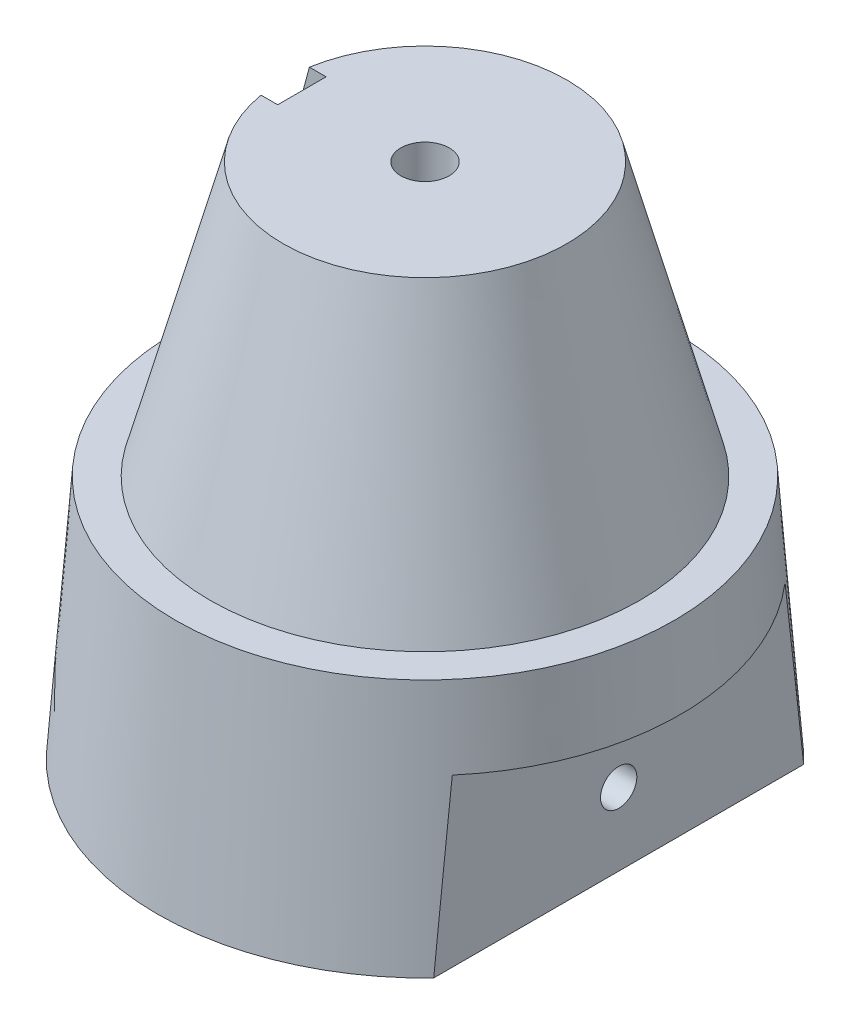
ISO-10303-21;
HEADER;
FILE_DESCRIPTION(('STEP AP214'),'2;1');
FILE_NAME('part.step','',(''),(''),'','','');
FILE_SCHEMA(('AUTOMOTIVE_DESIGN { 1 0 10303 214 1 1 1 1 }'));
ENDSEC;
DATA;
#1=APPLICATION_CONTEXT('core data for automotive mechanical design processes');
#2=APPLICATION_PROTOCOL_DEFINITION('international standard','automotive_design',2000,#1);
#3=PRODUCT_CONTEXT('',#1,'mechanical');
#4=PRODUCT('Part','Part','',(#3));
#5=PRODUCT_RELATED_PRODUCT_CATEGORY('part','',(#4));
#6=PRODUCT_DEFINITION_FORMATION('','',#4);
#7=PRODUCT_DEFINITION_CONTEXT('part definition',#1,'design');
#8=PRODUCT_DEFINITION('design','',#6,#7);
#9=PRODUCT_DEFINITION_SHAPE('','',#8);
#10=(LENGTH_UNIT() NAMED_UNIT(*) SI_UNIT(.MILLI.,.METRE.));
#11=(NAMED_UNIT(*) PLANE_ANGLE_UNIT() SI_UNIT($,.RADIAN.));
#12=(NAMED_UNIT(*) SI_UNIT($,.STERADIAN.) SOLID_ANGLE_UNIT());
#13=UNCERTAINTY_MEASURE_WITH_UNIT(LENGTH_MEASURE(1.E-05),#10,'distance_accuracy_value','');
#14=(GEOMETRIC_REPRESENTATION_CONTEXT(3) GLOBAL_UNCERTAINTY_ASSIGNED_CONTEXT((#13)) GLOBAL_UNIT_ASSIGNED_CONTEXT((#10,
#11,#12)) REPRESENTATION_CONTEXT('',''));
#15=CARTESIAN_POINT('',(0.,0.,0.));
#16=DIRECTION('',(0.,0.,1.));
#17=DIRECTION('',(1.,0.,0.));
#18=AXIS2_PLACEMENT_3D('',#15,#16,#17);
#19=CARTESIAN_POINT('',(0.,85.5,-23.4422863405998));
#20=DIRECTION('',(0.,-1.,0.));
#21=DIRECTION('',(0.,0.,-1.));
#22=AXIS2_PLACEMENT_3D('',#19,#20,#21);
#23=PLANE('',#22);
#24=CARTESIAN_POINT('',(0.,85.5,0.));
#25=DIRECTION('',(0.,1.,0.));
#26=DIRECTION('',(0.,0.,1.));
#27=AXIS2_PLACEMENT_3D('',#24,#25,#26);
#28=CIRCLE('',#27,3.99999999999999);
#29=CARTESIAN_POINT('',(0.,85.5,3.99999999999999));
#30=VERTEX_POINT('',#29);
#31=EDGE_CURVE('E244',#30,#30,#28,.T.);
#32=ORIENTED_EDGE('',*,*,#31,.F.);
#33=EDGE_LOOP('',(#32));
#34=FACE_BOUND('',#33,.T.);
#35=DIRECTION('',(1.,0.,0.));
#36=VECTOR('',#35,1.);
#37=CARTESIAN_POINT('',(0.,85.5,4.));
#38=LINE('',#37,#36);
#39=CARTESIAN_POINT('',(-23.0985018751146,85.5,4.));
#40=VERTEX_POINT('',#39);
#41=CARTESIAN_POINT('',(-20.3369652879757,85.5,4.));
#42=VERTEX_POINT('',#41);
#43=EDGE_CURVE('E125',#40,#42,#38,.T.);
#44=ORIENTED_EDGE('',*,*,#43,.F.);
#45=CARTESIAN_POINT('',(0.,85.5,0.));
#46=DIRECTION('',(0.,1.,0.));
#47=DIRECTION('',(0.,0.,1.));
#48=AXIS2_PLACEMENT_3D('',#45,#46,#47);
#49=CIRCLE('',#48,23.4422863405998);
#50=CARTESIAN_POINT('',(-23.0985018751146,85.5,-4.));
#51=VERTEX_POINT('',#50);
#52=EDGE_CURVE('E124',#40,#51,#49,.T.);
#53=ORIENTED_EDGE('',*,*,#52,.T.);
#54=DIRECTION('',(-1.,0.,0.));
#55=VECTOR('',#54,1.);
#56=CARTESIAN_POINT('',(0.,85.5,-4.));
#57=LINE('',#56,#55);
#58=CARTESIAN_POINT('',(-20.3369652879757,85.5,-4.));
#59=VERTEX_POINT('',#58);
#60=EDGE_CURVE('E105',#59,#51,#57,.T.);
#61=ORIENTED_EDGE('',*,*,#60,.F.);
#62=DIRECTION('',(0.,0.,-1.));
#63=VECTOR('',#62,1.);
#64=CARTESIAN_POINT('',(-20.3369652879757,85.5,-23.4422863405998));
#65=LINE('',#64,#63);
#66=EDGE_CURVE('E114',#42,#59,#65,.T.);
#67=ORIENTED_EDGE('',*,*,#66,.F.);
#68=EDGE_LOOP('',(#44,#53,#61,#67));
#69=FACE_BOUND('',#68,.T.);
#70=ADVANCED_FACE('F33',(#34,#69),#23,.F.);
#71=CARTESIAN_POINT('',(0.,40.5,0.));
#72=DIRECTION('',(0.,-1.,0.));
#73=DIRECTION('',(0.,0.,-1.));
#74=AXIS2_PLACEMENT_3D('',#71,#72,#73);
#75=CONICAL_SURFACE('',#74,35.5,0.261799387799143);
#76=CARTESIAN_POINT('',(0.,40.5,0.));
#77=DIRECTION('',(0.,1.,0.));
#78=DIRECTION('',(0.,0.,1.));
#79=AXIS2_PLACEMENT_3D('',#76,#77,#78);
#80=CIRCLE('',#79,35.5);
#81=CARTESIAN_POINT('',(0.,40.5,35.5));
#82=VERTEX_POINT('',#81);
#83=EDGE_CURVE('E229',#82,#82,#80,.T.);
#84=ORIENTED_EDGE('',*,*,#83,.T.);
#85=EDGE_LOOP('',(#84));
#86=FACE_BOUND('',#85,.T.);
#87=CARTESIAN_POINT('',(-31.749144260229,53.561701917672,4.));
#88=CARTESIAN_POINT('',(-31.7783688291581,53.4534685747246,4.00001124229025));
#89=CARTESIAN_POINT('',(-31.8081553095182,53.3453930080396,3.99528689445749));
#90=CARTESIAN_POINT('',(-31.8685948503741,53.1303156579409,3.97645475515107));
#91=CARTESIAN_POINT('',(-31.8992478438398,53.0233137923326,3.96234768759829));
#92=CARTESIAN_POINT('',(-31.9611353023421,52.8112363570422,3.924857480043));
#93=CARTESIAN_POINT('',(-31.9923691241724,52.7061588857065,3.9014840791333));
#94=CARTESIAN_POINT('',(-32.0551494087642,52.4985738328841,3.84565723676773));
#95=CARTESIAN_POINT('',(-32.0866958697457,52.3960662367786,3.81320384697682));
#96=CARTESIAN_POINT('',(-32.1813760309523,52.0933792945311,3.7025077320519));
#97=CARTESIAN_POINT('',(-32.244584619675,51.8979195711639,3.61090837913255));
#98=CARTESIAN_POINT('',(-32.3684184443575,51.5253666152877,3.3948548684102));
#99=CARTESIAN_POINT('',(-32.4290438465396,51.3482721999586,3.27040282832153));
#100=CARTESIAN_POINT('',(-32.5453302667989,51.0161562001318,2.9914651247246));
#101=CARTESIAN_POINT('',(-32.600967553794,50.8612382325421,2.83684597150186));
#102=CARTESIAN_POINT('',(-32.7043396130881,50.5784823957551,2.5022292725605));
#103=CARTESIAN_POINT('',(-32.7520728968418,50.4506496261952,2.3222269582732));
#104=CARTESIAN_POINT('',(-32.8373936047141,50.2251109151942,1.94136042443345));
#105=CARTESIAN_POINT('',(-32.8749517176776,50.1274918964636,1.74043819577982));
#106=CARTESIAN_POINT('',(-32.937790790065,49.9655218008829,1.32386705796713));
#107=CARTESIAN_POINT('',(-32.9630793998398,49.9011499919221,1.10822742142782));
#108=CARTESIAN_POINT('',(-32.9938253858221,49.823181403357,0.742745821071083));
#109=CARTESIAN_POINT('',(-33.0030942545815,49.7997831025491,0.59523056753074));
#110=CARTESIAN_POINT('',(-33.0154824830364,49.7685657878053,0.298498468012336));
#111=CARTESIAN_POINT('',(-33.0186097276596,49.7607267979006,0.149284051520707));
#112=CARTESIAN_POINT('',(-33.0185910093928,49.7607444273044,0.));
#113=B_SPLINE_CURVE_WITH_KNOTS('',3,(#87,#88,#89,#90,#91,#92,#93,#94,#95,#96,#97,#98,#99,#100,
#101,#102,#103,#104,#105,#106,#107,#108,#109,#110,#111,#112),.UNSPECIFIED.,.F.,.F.,(4,2,2,2,2,2,
2,2,2,2,2,2,4),(0.,0.336217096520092,0.672408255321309,1.00824700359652,1.34408384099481,
2.01539352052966,2.68665993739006,3.36096698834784,4.03540088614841,4.71175742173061,
5.38769168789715,5.8357465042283,6.28322570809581),.UNSPECIFIED.);
#114=CARTESIAN_POINT('',(-31.7491442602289,53.561701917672,4.));
#115=VERTEX_POINT('',#114);
#116=CARTESIAN_POINT('',(-33.0185910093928,49.7607444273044,0.));
#117=VERTEX_POINT('',#116);
#118=EDGE_CURVE('E43',#115,#117,#113,.T.);
#119=ORIENTED_EDGE('',*,*,#118,.T.);
#120=CARTESIAN_POINT('',(-33.0185910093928,49.7607444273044,0.));
#121=CARTESIAN_POINT('',(-33.018598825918,49.7607349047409,-0.112092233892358));
#122=CARTESIAN_POINT('',(-33.016839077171,49.765152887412,-0.224178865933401));
#123=CARTESIAN_POINT('',(-33.0098432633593,49.7827696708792,-0.447542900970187));
#124=CARTESIAN_POINT('',(-33.0046074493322,49.7959678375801,-0.55882036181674));
#125=CARTESIAN_POINT('',(-32.9907254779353,49.8310526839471,-0.779670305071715));
#126=CARTESIAN_POINT('',(-32.9820828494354,49.8529303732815,-0.889244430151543));
#127=CARTESIAN_POINT('',(-32.9615120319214,49.9052053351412,-1.10599401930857));
#128=CARTESIAN_POINT('',(-32.9495838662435,49.9356025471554,-1.21316950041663));
#129=CARTESIAN_POINT('',(-32.9090736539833,50.0393360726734,-1.53004314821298));
#130=CARTESIAN_POINT('',(-32.8757584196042,50.1252327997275,-1.73520462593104));
#131=CARTESIAN_POINT('',(-32.7982562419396,50.3281233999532,-2.12711286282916));
#132=CARTESIAN_POINT('',(-32.7540701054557,50.4451149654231,-2.31386098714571));
#133=CARTESIAN_POINT('',(-32.6567989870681,50.7077412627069,-2.66468033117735));
#134=CARTESIAN_POINT('',(-32.6036776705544,50.8534933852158,-2.82865375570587));
#135=CARTESIAN_POINT('',(-32.4912019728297,51.1695659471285,-3.12841944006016));
#136=CARTESIAN_POINT('',(-32.4318463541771,51.3398912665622,-3.26420608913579));
#137=CARTESIAN_POINT('',(-32.3094148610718,51.7012330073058,-3.50415877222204));
#138=CARTESIAN_POINT('',(-32.2463268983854,51.8923185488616,-3.60821449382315));
#139=CARTESIAN_POINT('',(-32.1193585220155,52.2895319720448,-3.78101690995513));
#140=CARTESIAN_POINT('',(-32.0554786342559,52.4956502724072,-3.84978587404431));
#141=CARTESIAN_POINT('',(-31.9507240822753,52.8460766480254,-3.93315933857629));
#142=CARTESIAN_POINT('',(-31.9093432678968,52.9878375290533,-3.95820404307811));
#143=CARTESIAN_POINT('',(-31.8280266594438,53.2735212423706,-3.99162485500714));
#144=CARTESIAN_POINT('',(-31.788089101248,53.4174411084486,-4.00002203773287));
#145=CARTESIAN_POINT('',(-31.7491442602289,53.561701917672,-4.));
#146=B_SPLINE_CURVE_WITH_KNOTS('',3,(#120,#121,#122,#123,#124,#125,#126,#127,#128,#129,#130,
#131,#132,#133,#134,#135,#136,#137,#138,#139,#140,#141,#142,#143,#144,#145),.UNSPECIFIED.,.F.,
.F.,(4,2,2,2,2,2,2,2,2,2,2,2,4),(0.,0.336165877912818,0.672307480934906,1.0081018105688,
1.34389375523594,2.01512865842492,2.68631375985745,3.36029729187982,4.0344148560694,
4.7108499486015,5.38685761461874,5.83532634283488,6.28322695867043),.UNSPECIFIED.);
#147=CARTESIAN_POINT('',(-31.7491442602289,53.561701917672,-4.));
#148=VERTEX_POINT('',#147);
#149=EDGE_CURVE('E11',#117,#148,#146,.T.);
#150=ORIENTED_EDGE('',*,*,#149,.T.);
#151=CARTESIAN_POINT('',(-18.218467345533,103.376046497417,-4.));
#152=CARTESIAN_POINT('',(-18.8717640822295,100.9944527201,-4.));
#153=CARTESIAN_POINT('',(-19.5236523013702,98.612473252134,-4.));
#154=CARTESIAN_POINT('',(-20.8251909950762,93.847903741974,-4.));
#155=CARTESIAN_POINT('',(-21.4748414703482,91.4653136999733,-4.));
#156=CARTESIAN_POINT('',(-22.7724838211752,86.6996843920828,-4.));
#157=CARTESIAN_POINT('',(-23.4204756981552,84.3166451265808,-4.));
#158=CARTESIAN_POINT('',(-24.7151567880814,79.550212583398,-4.));
#159=CARTESIAN_POINT('',(-25.3618460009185,77.1668193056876,-4.));
#160=CARTESIAN_POINT('',(-26.9091657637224,71.4592557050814,-4.));
#161=CARTESIAN_POINT('',(-27.809310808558,68.1349537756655,-4.));
#162=CARTESIAN_POINT('',(-29.6081149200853,61.4859468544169,-4.));
#163=CARTESIAN_POINT('',(-30.5067739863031,58.1612418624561,-4.));
#164=CARTESIAN_POINT('',(-32.4978951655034,50.7898320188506,-4.));
#165=CARTESIAN_POINT('',(-33.5900838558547,46.743053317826,-4.));
#166=CARTESIAN_POINT('',(-35.7732114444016,38.6491587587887,-3.99999999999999));
#167=CARTESIAN_POINT('',(-36.864150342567,34.6020429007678,-3.99999999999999));
#168=CARTESIAN_POINT('',(-39.0450738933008,26.5075582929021,-3.99999999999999));
#169=CARTESIAN_POINT('',(-40.1350585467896,22.4601895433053,-3.99999999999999));
#170=CARTESIAN_POINT('',(-42.3142716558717,14.3652487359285,-3.99999999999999));
#171=CARTESIAN_POINT('',(-43.4035001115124,10.3176766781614,-3.99999999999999));
#172=CARTESIAN_POINT('',(-44.4924490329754,6.27002945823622,-3.99999999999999));
#173=B_SPLINE_CURVE_WITH_KNOTS('',3,(#151,#152,#153,#154,#155,#156,#157,#158,#159,#160,#161,
#162,#163,#164,#165,#166,#167,#168,#169,#170,#171,#172),.UNSPECIFIED.,.F.,.F.,(4,2,2,2,2,2,2,2,
2,2,4),(0.,7.40871443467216,14.8174265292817,22.2261322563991,29.634838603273,39.9668853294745,
50.2989353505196,62.8736575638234,75.4483800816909,88.0230904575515,100.597800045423),.UNSPECIFIED.);
#174=EDGE_CURVE('E247',#51,#148,#173,.T.);
#175=ORIENTED_EDGE('',*,*,#174,.F.);
#176=ORIENTED_EDGE('',*,*,#52,.F.);
#177=CARTESIAN_POINT('',(-44.4924490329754,6.27002945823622,3.99999999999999));
#178=CARTESIAN_POINT('',(-43.4034989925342,10.3176810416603,3.99999999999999));
#179=CARTESIAN_POINT('',(-42.3142693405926,14.3652574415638,3.99999999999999));
#180=CARTESIAN_POINT('',(-40.1350539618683,22.4602064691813,3.99999999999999));
#181=CARTESIAN_POINT('',(-39.0450682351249,26.5075790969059,3.99999999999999));
#182=CARTESIAN_POINT('',(-36.8641449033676,34.6020632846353,3.99999999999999));
#183=CARTESIAN_POINT('',(-35.7732072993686,38.6491748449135,3.99999999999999));
#184=CARTESIAN_POINT('',(-33.5900815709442,46.743061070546,4.));
#185=CARTESIAN_POINT('',(-32.4978934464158,50.7898357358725,4.));
#186=CARTESIAN_POINT('',(-30.3118349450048,58.8829361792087,4.));
#187=CARTESIAN_POINT('',(-29.2179645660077,62.9292619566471,4.));
#188=CARTESIAN_POINT('',(-27.0278975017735,71.0212832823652,4.));
#189=CARTESIAN_POINT('',(-25.9317008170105,75.066978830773,4.));
#190=CARTESIAN_POINT('',(-24.2848632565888,81.1348347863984,4.));
#191=CARTESIAN_POINT('',(-23.7354933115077,83.1573401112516,4.));
#192=CARTESIAN_POINT('',(-22.6357025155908,87.2020648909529,4.));
#193=CARTESIAN_POINT('',(-22.0852816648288,89.224284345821,4.));
#194=CARTESIAN_POINT('',(-20.9831404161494,93.2683706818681,4.));
#195=CARTESIAN_POINT('',(-20.4314200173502,95.2902375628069,4.));
#196=CARTESIAN_POINT('',(-19.3262990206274,99.3335125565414,4.));
#197=CARTESIAN_POINT('',(-18.772898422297,101.354920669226,4.));
#198=CARTESIAN_POINT('',(-18.218467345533,103.376046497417,4.));
#199=B_SPLINE_CURVE_WITH_KNOTS('',3,(#177,#178,#179,#180,#181,#182,#183,#184,#185,#186,#187,
#188,#189,#190,#191,#192,#193,#194,#195,#196,#197,#198),.UNSPECIFIED.,.F.,.F.,(4,2,2,2,2,2,2,2,
2,2,4),(0.,12.5747230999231,25.1494455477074,37.7241546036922,50.2988646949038,62.8735906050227,
75.4483139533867,81.7356833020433,88.0230522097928,94.310425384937,100.597800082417),.UNSPECIFIED.);
#200=EDGE_CURVE('E120',#115,#40,#199,.T.);
#201=ORIENTED_EDGE('',*,*,#200,.F.);
#202=EDGE_LOOP('',(#119,#150,#175,#176,#201));
#203=FACE_BOUND('',#202,.T.);
#204=ADVANCED_FACE('F198',(#86,#203),#75,.T.);
#205=CARTESIAN_POINT('',(0.,0.,0.));
#206=DIRECTION('',(0.,-1.,0.));
#207=DIRECTION('',(0.,0.,-1.));
#208=AXIS2_PLACEMENT_3D('',#205,#206,#207);
#209=CONICAL_SURFACE('',#208,44.25,0.0748598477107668);
#210=CARTESIAN_POINT('',(0.,40.5,0.));
#211=DIRECTION('',(0.,1.,0.));
#212=DIRECTION('',(0.,0.,1.));
#213=AXIS2_PLACEMENT_3D('',#210,#211,#212);
#214=CIRCLE('',#213,41.2125);
#215=CARTESIAN_POINT('',(0.,40.5,41.2125));
#216=VERTEX_POINT('',#215);
#217=EDGE_CURVE('E226',#216,#216,#214,.T.);
#218=ORIENTED_EDGE('',*,*,#217,.F.);
#219=EDGE_LOOP('',(#218));
#220=FACE_BOUND('',#219,.T.);
#221=CARTESIAN_POINT('',(32.,-66.7259859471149,-37.4433003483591));
#222=CARTESIAN_POINT('',(32.,-63.3884773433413,-37.1140237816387));
#223=CARTESIAN_POINT('',(32.,-60.0511470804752,-36.7829411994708));
#224=CARTESIAN_POINT('',(32.,-53.3768783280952,-36.1168380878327));
#225=CARTESIAN_POINT('',(32.,-50.0399398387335,-35.7818175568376));
#226=CARTESIAN_POINT('',(32.,-40.0297783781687,-34.7703615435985));
#227=CARTESIAN_POINT('',(32.,-33.3571995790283,-34.0875306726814));
#228=CARTESIAN_POINT('',(32.,-20.0148934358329,-32.7015986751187));
#229=CARTESIAN_POINT('',(32.,-13.3451658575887,-31.998499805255));
#230=CARTESIAN_POINT('',(32.,-0.00831531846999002,-30.5676291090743));
#231=CARTESIAN_POINT('',(32.,6.65880762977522,-29.8398571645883));
#232=CARTESIAN_POINT('',(32.,16.6572647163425,-28.7251783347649));
#233=CARTESIAN_POINT('',(32.,19.9898810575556,-28.3497623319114));
#234=CARTESIAN_POINT('',(32.,26.6541287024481,-27.5902848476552));
#235=CARTESIAN_POINT('',(32.,29.9857600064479,-27.2062233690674));
#236=CARTESIAN_POINT('',(32.,36.6478376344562,-26.42831956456));
#237=CARTESIAN_POINT('',(32.,39.9782839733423,-26.0344773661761));
#238=CARTESIAN_POINT('',(32.,46.6378412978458,-25.2356081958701));
#239=CARTESIAN_POINT('',(32.,49.9669522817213,-24.830581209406));
#240=CARTESIAN_POINT('',(32.,56.62395449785,-24.0075681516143));
#241=CARTESIAN_POINT('',(32.,59.9518455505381,-23.5895806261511));
#242=CARTESIAN_POINT('',(32.,66.605691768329,-22.738523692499));
#243=CARTESIAN_POINT('',(32.,69.9316469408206,-22.3054543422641));
#244=CARTESIAN_POINT('',(32.,74.918866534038,-21.6424105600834));
#245=CARTESIAN_POINT('',(32.,76.5810247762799,-21.4191508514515));
#246=CARTESIAN_POINT('',(32.,79.9046723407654,-20.9677114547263));
#247=CARTESIAN_POINT('',(32.,81.5661616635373,-20.7395317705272));
#248=CARTESIAN_POINT('',(32.,84.8884103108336,-20.2777588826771));
#249=CARTESIAN_POINT('',(32.,86.5491696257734,-20.0441656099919));
#250=CARTESIAN_POINT('',(32.,89.8698351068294,-19.5709619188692));
#251=CARTESIAN_POINT('',(32.,91.5297412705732,-19.3313514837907));
#252=CARTESIAN_POINT('',(32.,93.1891652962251,-19.0884298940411));
#253=B_SPLINE_CURVE_WITH_KNOTS('',3,(#221,#222,#223,#224,#225,#226,#227,#228,#229,#230,#231,
#232,#233,#234,#235,#236,#237,#238,#239,#240,#241,#242,#243,#244,#245,#246,#247,#248,#249,#250,
#251,#252),.UNSPECIFIED.,.F.,.F.,(4,2,2,2,2,2,2,2,2,2,2,2,2,2,2,4),(0.,10.0611361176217,
20.1222761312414,40.2445265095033,60.3645449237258,80.4846597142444,90.545735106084,
100.606807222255,110.667748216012,120.728702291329,130.790789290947,140.852837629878,
145.884087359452,150.915333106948,155.946643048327,160.977966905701),.UNSPECIFIED.);
#254=CARTESIAN_POINT('',(32.,0.,-30.5624360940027));
#255=VERTEX_POINT('',#254);
#256=CARTESIAN_POINT('',(32.,27.5,-27.4915469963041));
#257=VERTEX_POINT('',#256);
#258=EDGE_CURVE('E205',#255,#257,#253,.T.);
#259=ORIENTED_EDGE('',*,*,#258,.F.);
#260=CARTESIAN_POINT('',(0.,0.,0.));
#261=DIRECTION('',(0.,1.,0.));
#262=DIRECTION('',(0.,0.,1.));
#263=AXIS2_PLACEMENT_3D('',#260,#261,#262);
#264=CIRCLE('',#263,44.25);
#265=CARTESIAN_POINT('',(-32.,0.,-30.5624360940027));
#266=VERTEX_POINT('',#265);
#267=EDGE_CURVE('E225',#255,#266,#264,.T.);
#268=ORIENTED_EDGE('',*,*,#267,.T.);
#269=CARTESIAN_POINT('',(-32.,93.1891652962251,-19.0884298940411));
#270=CARTESIAN_POINT('',(-32.,91.7594922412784,-19.2977261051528));
#271=CARTESIAN_POINT('',(-32.,90.3294600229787,-19.5045549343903));
#272=CARTESIAN_POINT('',(-32.,87.4687502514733,-19.9136820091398));
#273=CARTESIAN_POINT('',(-32.,86.038072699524,-20.1159802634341));
#274=CARTESIAN_POINT('',(-32.,81.7452016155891,-20.7166826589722));
#275=CARTESIAN_POINT('',(-32.,78.8821412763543,-21.1088985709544));
#276=CARTESIAN_POINT('',(-32.,73.1542338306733,-21.8793478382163));
#277=CARTESIAN_POINT('',(-32.,70.2893867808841,-22.257581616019));
#278=CARTESIAN_POINT('',(-32.,64.5581266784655,-23.0020408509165));
#279=CARTESIAN_POINT('',(-32.,61.6917136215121,-23.3682662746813));
#280=CARTESIAN_POINT('',(-32.,55.9577997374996,-24.0902485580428));
#281=CARTESIAN_POINT('',(-32.,53.0902990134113,-24.4460062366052));
#282=CARTESIAN_POINT('',(-32.,47.3541749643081,-25.1483558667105));
#283=CARTESIAN_POINT('',(-32.,44.4855516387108,-25.4949478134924));
#284=CARTESIAN_POINT('',(-32.,38.7473228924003,-26.1800167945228));
#285=CARTESIAN_POINT('',(-32.,35.8777174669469,-26.518493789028));
#286=CARTESIAN_POINT('',(-32.,30.1376627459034,-27.188207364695));
#287=CARTESIAN_POINT('',(-32.,27.2672134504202,-27.5194439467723));
#288=CARTESIAN_POINT('',(-32.,22.5513278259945,-28.058225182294));
#289=CARTESIAN_POINT('',(-32.,20.7061091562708,-28.267677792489));
#290=CARTESIAN_POINT('',(-32.,17.0153776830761,-28.6840661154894));
#291=CARTESIAN_POINT('',(-32.,15.1698648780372,-28.8910018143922));
#292=CARTESIAN_POINT('',(-32.,6.6583694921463,-29.8399039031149));
#293=CARTESIAN_POINT('',(-32.,-0.00919345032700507,-30.5677244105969));
#294=CARTESIAN_POINT('',(-32.,-13.3469782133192,-31.998693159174));
#295=CARTESIAN_POINT('',(-32.,-20.0172000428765,-32.7018413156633));
#296=CARTESIAN_POINT('',(-32.,-33.3595633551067,-34.0877731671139));
#297=CARTESIAN_POINT('',(-32.,-40.0317047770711,-34.7705574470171));
#298=CARTESIAN_POINT('',(-32.,-50.0411807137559,-35.781942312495));
#299=CARTESIAN_POINT('',(-32.,-53.3778711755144,-36.116937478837));
#300=CARTESIAN_POINT('',(-32.,-60.051643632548,-36.7829904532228));
#301=CARTESIAN_POINT('',(-32.,-63.3887256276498,-37.1140482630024));
#302=CARTESIAN_POINT('',(-32.,-66.7259859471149,-37.4433003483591));
#303=B_SPLINE_CURVE_WITH_KNOTS('',3,(#269,#270,#271,#272,#273,#274,#275,#276,#277,#278,#279,
#280,#281,#282,#283,#284,#285,#286,#287,#288,#289,#290,#291,#292,#293,#294,#295,#296,#297,#298,
#299,#300,#301,#302),.UNSPECIFIED.,.F.,.F.,(4,2,2,2,2,2,2,2,2,2,2,2,2,2,2,2,4),(0.,
4.33472982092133,8.66945123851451,17.3388080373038,26.0079026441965,34.6770213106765,
43.3454599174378,52.0139030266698,60.6823885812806,69.3508730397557,74.9220759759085,
80.4933096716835,100.614749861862,120.736259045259,140.857189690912,150.917581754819,
160.977969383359),.UNSPECIFIED.);
#304=CARTESIAN_POINT('',(-32.,27.5,-27.4915469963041));
#305=VERTEX_POINT('',#304);
#306=EDGE_CURVE('E183',#305,#266,#303,.T.);
#307=ORIENTED_EDGE('',*,*,#306,.F.);
#308=CARTESIAN_POINT('',(0.,27.5,0.));
#309=DIRECTION('',(0.,-1.,0.));
#310=DIRECTION('',(0.,0.,-1.));
#311=AXIS2_PLACEMENT_3D('',#308,#309,#310);
#312=CIRCLE('',#311,42.1875);
#313=CARTESIAN_POINT('',(-32.,27.5,27.4915469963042));
#314=VERTEX_POINT('',#313);
#315=EDGE_CURVE('E237',#314,#305,#312,.T.);
#316=ORIENTED_EDGE('',*,*,#315,.F.);
#317=CARTESIAN_POINT('',(-32.,-66.7259859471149,37.4433003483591));
#318=CARTESIAN_POINT('',(-32.,-63.3884773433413,37.1140237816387));
#319=CARTESIAN_POINT('',(-32.,-60.0511470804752,36.7829411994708));
#320=CARTESIAN_POINT('',(-32.,-53.3768783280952,36.1168380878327));
#321=CARTESIAN_POINT('',(-32.,-50.0399398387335,35.7818175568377));
#322=CARTESIAN_POINT('',(-32.,-40.0297783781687,34.7703615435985));
#323=CARTESIAN_POINT('',(-32.,-33.3571995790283,34.0875306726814));
#324=CARTESIAN_POINT('',(-32.,-20.0148934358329,32.7015986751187));
#325=CARTESIAN_POINT('',(-32.,-13.3451658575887,31.998499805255));
#326=CARTESIAN_POINT('',(-32.,-0.00831531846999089,30.5676291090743));
#327=CARTESIAN_POINT('',(-32.,6.65880762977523,29.8398571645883));
#328=CARTESIAN_POINT('',(-32.,16.6572647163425,28.7251783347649));
#329=CARTESIAN_POINT('',(-32.,19.9898810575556,28.3497623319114));
#330=CARTESIAN_POINT('',(-32.,26.6541287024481,27.5902848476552));
#331=CARTESIAN_POINT('',(-32.,29.9857600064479,27.2062233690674));
#332=CARTESIAN_POINT('',(-32.,36.6478376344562,26.4283195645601));
#333=CARTESIAN_POINT('',(-32.,39.9782839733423,26.0344773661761));
#334=CARTESIAN_POINT('',(-32.,46.6378412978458,25.2356081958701));
#335=CARTESIAN_POINT('',(-32.,49.9669522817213,24.830581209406));
#336=CARTESIAN_POINT('',(-32.,56.62395449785,24.0075681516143));
#337=CARTESIAN_POINT('',(-32.,59.9518455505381,23.5895806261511));
#338=CARTESIAN_POINT('',(-32.,66.605691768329,22.738523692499));
#339=CARTESIAN_POINT('',(-32.,69.9316469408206,22.3054543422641));
#340=CARTESIAN_POINT('',(-32.,74.918866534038,21.6424105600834));
#341=CARTESIAN_POINT('',(-32.,76.5810247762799,21.4191508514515));
#342=CARTESIAN_POINT('',(-32.,79.9046723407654,20.9677114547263));
#343=CARTESIAN_POINT('',(-32.,81.5661616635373,20.7395317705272));
#344=CARTESIAN_POINT('',(-32.,84.8884103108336,20.2777588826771));
#345=CARTESIAN_POINT('',(-32.,86.5491696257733,20.044165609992));
#346=CARTESIAN_POINT('',(-32.,89.8698351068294,19.5709619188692));
#347=CARTESIAN_POINT('',(-32.,91.5297412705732,19.3313514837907));
#348=CARTESIAN_POINT('',(-32.,93.1891652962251,19.0884298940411));
#349=B_SPLINE_CURVE_WITH_KNOTS('',3,(#317,#318,#319,#320,#321,#322,#323,#324,#325,#326,#327,
#328,#329,#330,#331,#332,#333,#334,#335,#336,#337,#338,#339,#340,#341,#342,#343,#344,#345,#346,
#347,#348),.UNSPECIFIED.,.F.,.F.,(4,2,2,2,2,2,2,2,2,2,2,2,2,2,2,4),(0.,10.0611361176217,
20.1222761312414,40.2445265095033,60.3645449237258,80.4846597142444,90.545735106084,
100.606807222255,110.667748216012,120.728702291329,130.790789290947,140.852837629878,
145.884087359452,150.915333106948,155.946643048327,160.977966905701),.UNSPECIFIED.);
#350=CARTESIAN_POINT('',(-32.,0.,30.5624360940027));
#351=VERTEX_POINT('',#350);
#352=EDGE_CURVE('E176',#351,#314,#349,.T.);
#353=ORIENTED_EDGE('',*,*,#352,.F.);
#354=CARTESIAN_POINT('',(32.,0.,30.5624360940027));
#355=VERTEX_POINT('',#354);
#356=EDGE_CURVE('E222',#351,#355,#264,.T.);
#357=ORIENTED_EDGE('',*,*,#356,.T.);
#358=CARTESIAN_POINT('',(32.,93.1891652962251,19.0884298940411));
#359=CARTESIAN_POINT('',(32.,91.7594922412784,19.2977261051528));
#360=CARTESIAN_POINT('',(32.,90.3294600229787,19.5045549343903));
#361=CARTESIAN_POINT('',(32.,87.4687502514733,19.9136820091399));
#362=CARTESIAN_POINT('',(32.,86.038072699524,20.1159802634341));
#363=CARTESIAN_POINT('',(32.,81.7452016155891,20.7166826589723));
#364=CARTESIAN_POINT('',(32.,78.8821412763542,21.1088985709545));
#365=CARTESIAN_POINT('',(32.,73.1542338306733,21.8793478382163));
#366=CARTESIAN_POINT('',(32.,70.289386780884,22.257581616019));
#367=CARTESIAN_POINT('',(32.,64.5581266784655,23.0020408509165));
#368=CARTESIAN_POINT('',(32.,61.6917136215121,23.3682662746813));
#369=CARTESIAN_POINT('',(32.,55.9577997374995,24.0902485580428));
#370=CARTESIAN_POINT('',(32.,53.0902990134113,24.4460062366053));
#371=CARTESIAN_POINT('',(32.,47.3541749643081,25.1483558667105));
#372=CARTESIAN_POINT('',(32.,44.4855516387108,25.4949478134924));
#373=CARTESIAN_POINT('',(32.,38.7473228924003,26.1800167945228));
#374=CARTESIAN_POINT('',(32.,35.8777174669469,26.518493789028));
#375=CARTESIAN_POINT('',(32.,30.1376627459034,27.188207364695));
#376=CARTESIAN_POINT('',(32.,27.2672134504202,27.5194439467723));
#377=CARTESIAN_POINT('',(32.,22.5513278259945,28.058225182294));
#378=CARTESIAN_POINT('',(32.,20.7061091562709,28.267677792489));
#379=CARTESIAN_POINT('',(32.,17.0153776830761,28.6840661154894));
#380=CARTESIAN_POINT('',(32.,15.1698648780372,28.8910018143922));
#381=CARTESIAN_POINT('',(32.,6.65836949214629,29.8399039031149));
#382=CARTESIAN_POINT('',(32.,-0.00919345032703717,30.5677244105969));
#383=CARTESIAN_POINT('',(32.,-13.3469782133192,31.998693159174));
#384=CARTESIAN_POINT('',(32.,-20.0172000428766,32.7018413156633));
#385=CARTESIAN_POINT('',(32.,-33.3595633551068,34.087773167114));
#386=CARTESIAN_POINT('',(32.,-40.0317047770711,34.7705574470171));
#387=CARTESIAN_POINT('',(32.,-50.041180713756,35.781942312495));
#388=CARTESIAN_POINT('',(32.,-53.3778711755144,36.116937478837));
#389=CARTESIAN_POINT('',(32.,-60.051643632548,36.7829904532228));
#390=CARTESIAN_POINT('',(32.,-63.3887256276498,37.1140482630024));
#391=CARTESIAN_POINT('',(32.,-66.7259859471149,37.4433003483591));
#392=B_SPLINE_CURVE_WITH_KNOTS('',3,(#358,#359,#360,#361,#362,#363,#364,#365,#366,#367,#368,
#369,#370,#371,#372,#373,#374,#375,#376,#377,#378,#379,#380,#381,#382,#383,#384,#385,#386,#387,
#388,#389,#390,#391),.UNSPECIFIED.,.F.,.F.,(4,2,2,2,2,2,2,2,2,2,2,2,2,2,2,2,4),(0.,
4.33472982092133,8.66945123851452,17.3388080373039,26.0079026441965,34.6770213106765,
43.3454599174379,52.0139030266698,60.6823885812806,69.3508730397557,74.9220759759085,
80.4933096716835,100.614749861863,120.736259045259,140.857189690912,150.917581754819,
160.977969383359),.UNSPECIFIED.);
#393=CARTESIAN_POINT('',(32.,27.5,27.4915469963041));
#394=VERTEX_POINT('',#393);
#395=EDGE_CURVE('E188',#394,#355,#392,.T.);
#396=ORIENTED_EDGE('',*,*,#395,.F.);
#397=EDGE_CURVE('E239',#257,#394,#312,.T.);
#398=ORIENTED_EDGE('',*,*,#397,.F.);
#399=EDGE_LOOP('',(#259,#268,#307,#316,#353,#357,#396,#398));
#400=FACE_BOUND('',#399,.T.);
#401=ADVANCED_FACE('F193',(#220,#400),#209,.T.);
#402=CARTESIAN_POINT('',(0.,0.,0.));
#403=DIRECTION('',(0.,1.,0.));
#404=DIRECTION('',(0.,0.,1.));
#405=AXIS2_PLACEMENT_3D('',#402,#403,#404);
#406=PLANE('',#405);
#407=CARTESIAN_POINT('',(0.,0.,0.));
#408=DIRECTION('',(0.,-1.,0.));
#409=DIRECTION('',(0.,0.,-1.));
#410=AXIS2_PLACEMENT_3D('',#407,#408,#409);
#411=CIRCLE('',#410,21.);
#412=CARTESIAN_POINT('',(0.,0.,-21.));
#413=VERTEX_POINT('',#412);
#414=EDGE_CURVE('E219',#413,#413,#411,.T.);
#415=ORIENTED_EDGE('',*,*,#414,.F.);
#416=EDGE_LOOP('',(#415));
#417=FACE_BOUND('',#416,.T.);
#418=DIRECTION('',(0.,0.,-1.));
#419=VECTOR('',#418,1.);
#420=CARTESIAN_POINT('',(32.,0.,0.));
#421=LINE('',#420,#419);
#422=EDGE_CURVE('E235',#355,#255,#421,.T.);
#423=ORIENTED_EDGE('',*,*,#422,.F.);
#424=ORIENTED_EDGE('',*,*,#356,.F.);
#425=DIRECTION('',(0.,0.,1.));
#426=VECTOR('',#425,1.);
#427=CARTESIAN_POINT('',(-32.,0.,0.));
#428=LINE('',#427,#426);
#429=EDGE_CURVE('E233',#266,#351,#428,.T.);
#430=ORIENTED_EDGE('',*,*,#429,.F.);
#431=ORIENTED_EDGE('',*,*,#267,.F.);
#432=EDGE_LOOP('',(#423,#424,#430,#431));
#433=FACE_BOUND('',#432,.T.);
#434=ADVANCED_FACE('F197',(#417,#433),#406,.F.);
#435=CARTESIAN_POINT('',(0.,40.5,-41.2125));
#436=DIRECTION('',(0.,-1.,0.));
#437=DIRECTION('',(0.,0.,-1.));
#438=AXIS2_PLACEMENT_3D('',#435,#436,#437);
#439=PLANE('',#438);
#440=ORIENTED_EDGE('',*,*,#83,.F.);
#441=EDGE_LOOP('',(#440));
#442=FACE_BOUND('',#441,.T.);
#443=ORIENTED_EDGE('',*,*,#217,.T.);
#444=EDGE_LOOP('',(#443));
#445=FACE_BOUND('',#444,.T.);
#446=ADVANCED_FACE('F200',(#442,#445),#439,.F.);
#447=CARTESIAN_POINT('',(0.,65.,0.));
#448=DIRECTION('',(0.,-1.,0.));
#449=DIRECTION('',(0.,0.,-1.));
#450=AXIS2_PLACEMENT_3D('',#447,#448,#449);
#451=CYLINDRICAL_SURFACE('',#450,21.);
#452=CARTESIAN_POINT('',(20.7846096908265,12.,2.99999999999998));
#453=CARTESIAN_POINT('',(20.7846123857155,11.8324137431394,2.99999301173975));
#454=CARTESIAN_POINT('',(20.7866584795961,11.6647279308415,2.98590996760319));
#455=CARTESIAN_POINT('',(20.7946169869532,11.3340380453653,2.92996110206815));
#456=CARTESIAN_POINT('',(20.8005332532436,11.1710388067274,2.88806759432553));
#457=CARTESIAN_POINT('',(20.8155486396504,10.8545569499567,2.77777108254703));
#458=CARTESIAN_POINT('',(20.8246454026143,10.7010673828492,2.70938770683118));
#459=CARTESIAN_POINT('',(20.8449939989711,10.407765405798,2.54809763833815));
#460=CARTESIAN_POINT('',(20.8562455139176,10.2679509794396,2.45519456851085));
#461=CARTESIAN_POINT('',(20.8797273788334,10.004927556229,2.24678020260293));
#462=CARTESIAN_POINT('',(20.891963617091,9.88183242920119,2.13112584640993));
#463=CARTESIAN_POINT('',(20.9159835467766,9.65672766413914,1.88080061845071));
#464=CARTESIAN_POINT('',(20.9277672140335,9.55471915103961,1.74612873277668));
#465=CARTESIAN_POINT('',(20.9496155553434,9.37426635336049,1.46086557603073));
#466=CARTESIAN_POINT('',(20.9596725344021,9.29592642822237,1.31020764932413));
#467=CARTESIAN_POINT('',(20.9768692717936,9.16570389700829,0.997705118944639));
#468=CARTESIAN_POINT('',(20.9840091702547,9.11382002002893,0.835861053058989));
#469=CARTESIAN_POINT('',(20.9945257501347,9.03832618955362,0.506751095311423));
#470=CARTESIAN_POINT('',(20.9979277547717,9.01452589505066,0.339529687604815));
#471=CARTESIAN_POINT('',(21.0006719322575,8.99528415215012,0.00343434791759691));
#472=CARTESIAN_POINT('',(21.0000143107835,8.99984126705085,-0.165439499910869));
#473=CARTESIAN_POINT('',(20.994733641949,9.03703406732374,-0.498748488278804));
#474=CARTESIAN_POINT('',(20.9901395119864,9.06946499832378,-0.663206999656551));
#475=CARTESIAN_POINT('',(20.9775342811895,9.16116383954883,-0.984323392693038));
#476=CARTESIAN_POINT('',(20.9695230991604,9.22043238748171,-1.14098108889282));
#477=CARTESIAN_POINT('',(20.9509341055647,9.36433611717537,-1.4426729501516));
#478=CARTESIAN_POINT('',(20.9403475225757,9.44905822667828,-1.5876650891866));
#479=CARTESIAN_POINT('',(20.9177890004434,9.64140073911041,-1.86145173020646));
#480=CARTESIAN_POINT('',(20.9058169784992,9.74902251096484,-1.99024526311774));
#481=CARTESIAN_POINT('',(20.881698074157,9.985251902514,-2.22918448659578));
#482=CARTESIAN_POINT('',(20.8695505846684,10.1140381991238,-2.33915353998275));
#483=CARTESIAN_POINT('',(20.846554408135,10.3883317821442,-2.53594484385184));
#484=CARTESIAN_POINT('',(20.8357057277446,10.5338391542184,-2.62276697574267));
#485=CARTESIAN_POINT('',(20.8165358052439,10.8376204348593,-2.77081952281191));
#486=CARTESIAN_POINT('',(20.808216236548,10.9959027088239,-2.83203300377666));
#487=CARTESIAN_POINT('',(20.7950769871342,11.3206463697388,-2.9269593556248));
#488=CARTESIAN_POINT('',(20.7902570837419,11.4871072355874,-2.96067397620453));
#489=CARTESIAN_POINT('',(20.7847047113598,11.8219148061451,-2.9994058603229));
#490=CARTESIAN_POINT('',(20.7839366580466,11.9902320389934,-3.00467296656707));
#491=CARTESIAN_POINT('',(20.7864805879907,12.3253467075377,-2.9870221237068));
#492=CARTESIAN_POINT('',(20.7897924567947,12.4921441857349,-2.96410496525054));
#493=CARTESIAN_POINT('',(20.8000904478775,12.8187182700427,-2.89094756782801));
#494=CARTESIAN_POINT('',(20.8070599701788,12.978523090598,-2.8408307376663));
#495=CARTESIAN_POINT('',(20.8238743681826,13.2874631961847,-2.71482459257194));
#496=CARTESIAN_POINT('',(20.8337193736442,13.4365979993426,-2.63893411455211));
#497=CARTESIAN_POINT('',(20.8552597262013,13.7210878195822,-2.46293040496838));
#498=CARTESIAN_POINT('',(20.8669672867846,13.8563414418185,-2.36265480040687));
#499=CARTESIAN_POINT('',(20.8908763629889,14.1081895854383,-2.14095416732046));
#500=CARTESIAN_POINT('',(20.9030779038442,14.2247831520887,-2.01952805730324));
#501=CARTESIAN_POINT('',(20.9267107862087,14.4368928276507,-1.75787562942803));
#502=CARTESIAN_POINT('',(20.9381356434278,14.5322437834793,-1.61751475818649));
#503=CARTESIAN_POINT('',(20.9588283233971,14.6980133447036,-1.32262305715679));
#504=CARTESIAN_POINT('',(20.9680962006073,14.7684325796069,-1.16809258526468));
#505=CARTESIAN_POINT('',(20.9834021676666,14.8820731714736,-0.849773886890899));
#506=CARTESIAN_POINT('',(20.9894511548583,14.9253863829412,-0.686018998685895));
#507=CARTESIAN_POINT('',(20.9976833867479,14.9838832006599,-0.353467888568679));
#508=CARTESIAN_POINT('',(20.9998668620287,14.9990684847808,-0.184671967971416));
#509=CARTESIAN_POINT('',(21.0001201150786,15.0008403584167,0.151564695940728));
#510=CARTESIAN_POINT('',(20.9982263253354,14.9876802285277,0.319004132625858));
#511=CARTESIAN_POINT('',(20.9906109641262,14.9336757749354,0.649263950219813));
#512=CARTESIAN_POINT('',(20.9848894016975,14.8928315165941,0.812084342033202));
#513=CARTESIAN_POINT('',(20.9702583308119,14.7847050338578,1.12842557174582));
#514=CARTESIAN_POINT('',(20.9613507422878,14.7174387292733,1.28195194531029));
#515=CARTESIAN_POINT('',(20.9413284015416,14.5584042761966,1.57557855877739));
#516=CARTESIAN_POINT('',(20.9302135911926,14.4666354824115,1.71567844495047));
#517=CARTESIAN_POINT('',(20.9068957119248,14.2602784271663,1.97976292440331));
#518=CARTESIAN_POINT('',(20.894684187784,14.1455026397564,2.10360024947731));
#519=CARTESIAN_POINT('',(20.8706133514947,13.896783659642,2.33035075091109));
#520=CARTESIAN_POINT('',(20.858754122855,13.7628359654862,2.43325899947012));
#521=CARTESIAN_POINT('',(20.8366663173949,13.4787818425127,2.61569285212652));
#522=CARTESIAN_POINT('',(20.8264463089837,13.3285969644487,2.69509731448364));
#523=CARTESIAN_POINT('',(20.8088944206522,13.0169515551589,2.82743853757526));
#524=CARTESIAN_POINT('',(20.8015595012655,12.8555031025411,2.88040316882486));
#525=CARTESIAN_POINT('',(20.7923293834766,12.5777453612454,2.94613882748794));
#526=CARTESIAN_POINT('',(20.7894495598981,12.4631634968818,2.96630643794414));
#527=CARTESIAN_POINT('',(20.7855887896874,12.2324037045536,2.99323937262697));
#528=CARTESIAN_POINT('',(20.784607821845,12.1162257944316,3.0000048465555));
#529=CARTESIAN_POINT('',(20.7846096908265,12.,2.99999999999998));
#530=B_SPLINE_CURVE_WITH_KNOTS('',3,(#452,#453,#454,#455,#456,#457,#458,#459,#460,#461,#462,
#463,#464,#465,#466,#467,#468,#469,#470,#471,#472,#473,#474,#475,#476,#477,#478,#479,#480,#481,
#482,#483,#484,#485,#486,#487,#488,#489,#490,#491,#492,#493,#494,#495,#496,#497,#498,#499,#500,
#501,#502,#503,#504,#505,#506,#507,#508,#509,#510,#511,#512,#513,#514,#515,#516,#517,#518,#519,
#520,#521,#522,#523,#524,#525,#526,#527,#528,#529),.UNSPECIFIED.,.T.,.F.,(4,2,2,2,2,2,2,2,2,2,2,
2,2,2,2,2,2,2,2,2,2,2,2,2,2,2,2,2,2,2,2,2,2,2,2,2,2,2,4),(0.,0.502334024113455,1.00516889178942,
1.50763188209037,2.0100206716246,2.51567573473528,3.02135776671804,3.52923796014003,
4.03709375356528,4.54148733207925,5.04585535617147,5.5465497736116,6.04725608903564,
6.54969221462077,7.05215838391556,7.55910776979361,8.06605975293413,8.57334643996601,
9.08060084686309,9.58339291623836,10.0861708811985,10.5866865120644,11.0872247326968,
11.5911918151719,12.095184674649,12.6029688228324,13.1107401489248,13.6167813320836,
14.1227923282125,14.6243006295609,15.1258077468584,15.6270131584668,16.1282317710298,
16.6337152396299,17.1393175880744,17.6474822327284,18.1551100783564,18.5034967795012,
18.8518795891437),.UNSPECIFIED.);
#531=CARTESIAN_POINT('',(20.7846096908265,12.,2.99999999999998));
#532=VERTEX_POINT('',#531);
#533=EDGE_CURVE('E141',#532,#532,#530,.T.);
#534=ORIENTED_EDGE('',*,*,#533,.T.);
#535=EDGE_LOOP('',(#534));
#536=FACE_BOUND('',#535,.T.);
#537=CARTESIAN_POINT('',(-20.7846096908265,12.,2.99999999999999));
#538=CARTESIAN_POINT('',(-20.7846123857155,12.1675862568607,2.99999301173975));
#539=CARTESIAN_POINT('',(-20.7866584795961,12.3352720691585,2.98590996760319));
#540=CARTESIAN_POINT('',(-20.7946169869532,12.6659619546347,2.92996110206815));
#541=CARTESIAN_POINT('',(-20.8005332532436,12.8289611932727,2.88806759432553));
#542=CARTESIAN_POINT('',(-20.8155486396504,13.1454430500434,2.77777108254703));
#543=CARTESIAN_POINT('',(-20.8246454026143,13.2989326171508,2.70938770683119));
#544=CARTESIAN_POINT('',(-20.8449939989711,13.5922345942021,2.54809763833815));
#545=CARTESIAN_POINT('',(-20.8562455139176,13.7320490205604,2.45519456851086));
#546=CARTESIAN_POINT('',(-20.8797273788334,13.995072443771,2.24678020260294));
#547=CARTESIAN_POINT('',(-20.891963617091,14.1181675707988,2.13112584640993));
#548=CARTESIAN_POINT('',(-20.9159835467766,14.3432723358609,1.88080061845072));
#549=CARTESIAN_POINT('',(-20.9277672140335,14.4452808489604,1.74612873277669));
#550=CARTESIAN_POINT('',(-20.9496155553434,14.6257336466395,1.46086557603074));
#551=CARTESIAN_POINT('',(-20.9596725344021,14.7040735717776,1.31020764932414));
#552=CARTESIAN_POINT('',(-20.9768692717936,14.8342961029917,0.997705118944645));
#553=CARTESIAN_POINT('',(-20.9840091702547,14.8861799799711,0.835861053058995));
#554=CARTESIAN_POINT('',(-20.9945257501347,14.9616738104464,0.506751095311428));
#555=CARTESIAN_POINT('',(-20.9979277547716,14.9854741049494,0.33952968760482));
#556=CARTESIAN_POINT('',(-21.0006719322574,15.0047158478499,0.00343434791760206));
#557=CARTESIAN_POINT('',(-21.0000143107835,15.0001587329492,-0.165439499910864));
#558=CARTESIAN_POINT('',(-20.994733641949,14.9629659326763,-0.498748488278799));
#559=CARTESIAN_POINT('',(-20.9901395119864,14.9305350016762,-0.663206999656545));
#560=CARTESIAN_POINT('',(-20.9775342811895,14.8388361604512,-0.984323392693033));
#561=CARTESIAN_POINT('',(-20.9695230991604,14.7795676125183,-1.14098108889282));
#562=CARTESIAN_POINT('',(-20.9509341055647,14.6356638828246,-1.4426729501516));
#563=CARTESIAN_POINT('',(-20.9403475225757,14.5509417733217,-1.58766508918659));
#564=CARTESIAN_POINT('',(-20.9177890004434,14.3585992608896,-1.86145173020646));
#565=CARTESIAN_POINT('',(-20.9058169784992,14.2509774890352,-1.99024526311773));
#566=CARTESIAN_POINT('',(-20.881698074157,14.014748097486,-2.22918448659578));
#567=CARTESIAN_POINT('',(-20.8695505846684,13.8859618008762,-2.33915353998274));
#568=CARTESIAN_POINT('',(-20.846554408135,13.6116682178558,-2.53594484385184));
#569=CARTESIAN_POINT('',(-20.8357057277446,13.4661608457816,-2.62276697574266));
#570=CARTESIAN_POINT('',(-20.8165358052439,13.1623795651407,-2.77081952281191));
#571=CARTESIAN_POINT('',(-20.808216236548,13.0040972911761,-2.83203300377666));
#572=CARTESIAN_POINT('',(-20.7950769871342,12.6793536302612,-2.92695935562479));
#573=CARTESIAN_POINT('',(-20.7902570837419,12.5128927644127,-2.96067397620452));
#574=CARTESIAN_POINT('',(-20.7847047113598,12.1780851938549,-2.99940586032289));
#575=CARTESIAN_POINT('',(-20.7839366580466,12.0097679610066,-3.00467296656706));
#576=CARTESIAN_POINT('',(-20.7864805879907,11.6746532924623,-2.98702212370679));
#577=CARTESIAN_POINT('',(-20.7897924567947,11.5078558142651,-2.96410496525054));
#578=CARTESIAN_POINT('',(-20.8000904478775,11.1812817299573,-2.89094756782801));
#579=CARTESIAN_POINT('',(-20.8070599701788,11.021476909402,-2.84083073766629));
#580=CARTESIAN_POINT('',(-20.8238743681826,10.7125368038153,-2.71482459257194));
#581=CARTESIAN_POINT('',(-20.8337193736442,10.5634020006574,-2.63893411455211));
#582=CARTESIAN_POINT('',(-20.8552597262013,10.2789121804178,-2.46293040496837));
#583=CARTESIAN_POINT('',(-20.8669672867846,10.1436585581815,-2.36265480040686));
#584=CARTESIAN_POINT('',(-20.8908763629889,9.89181041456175,-2.14095416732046));
#585=CARTESIAN_POINT('',(-20.9030779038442,9.77521684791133,-2.01952805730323));
#586=CARTESIAN_POINT('',(-20.9267107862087,9.56310717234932,-1.75787562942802));
#587=CARTESIAN_POINT('',(-20.9381356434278,9.46775621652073,-1.61751475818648));
#588=CARTESIAN_POINT('',(-20.9588283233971,9.30198665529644,-1.32262305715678));
#589=CARTESIAN_POINT('',(-20.9680962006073,9.23156742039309,-1.16809258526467));
#590=CARTESIAN_POINT('',(-20.9834021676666,9.11792682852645,-0.849773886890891));
#591=CARTESIAN_POINT('',(-20.9894511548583,9.07461361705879,-0.686018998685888));
#592=CARTESIAN_POINT('',(-20.9976833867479,9.01611679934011,-0.353467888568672));
#593=CARTESIAN_POINT('',(-20.9998668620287,9.00093151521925,-0.184671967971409));
#594=CARTESIAN_POINT('',(-21.0001201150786,8.99915964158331,0.151564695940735));
#595=CARTESIAN_POINT('',(-20.9982263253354,9.01231977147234,0.319004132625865));
#596=CARTESIAN_POINT('',(-20.9906109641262,9.0663242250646,0.64926395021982));
#597=CARTESIAN_POINT('',(-20.9848894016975,9.10716848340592,0.81208434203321));
#598=CARTESIAN_POINT('',(-20.9702583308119,9.21529496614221,1.12842557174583));
#599=CARTESIAN_POINT('',(-20.9613507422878,9.28256127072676,1.2819519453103));
#600=CARTESIAN_POINT('',(-20.9413284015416,9.44159572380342,1.57557855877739));
#601=CARTESIAN_POINT('',(-20.9302135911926,9.53336451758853,1.71567844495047));
#602=CARTESIAN_POINT('',(-20.9068957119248,9.73972157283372,1.97976292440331));
#603=CARTESIAN_POINT('',(-20.894684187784,9.85449736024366,2.10360024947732));
#604=CARTESIAN_POINT('',(-20.8706133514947,10.1032163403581,2.3303507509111));
#605=CARTESIAN_POINT('',(-20.858754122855,10.2371640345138,2.43325899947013));
#606=CARTESIAN_POINT('',(-20.8366663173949,10.5212181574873,2.61569285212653));
#607=CARTESIAN_POINT('',(-20.8264463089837,10.6714030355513,2.69509731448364));
#608=CARTESIAN_POINT('',(-20.8088944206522,10.9830484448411,2.82743853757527));
#609=CARTESIAN_POINT('',(-20.8015595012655,11.144496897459,2.88040316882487));
#610=CARTESIAN_POINT('',(-20.7923293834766,11.4222546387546,2.94613882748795));
#611=CARTESIAN_POINT('',(-20.7894495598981,11.5368365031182,2.96630643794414));
#612=CARTESIAN_POINT('',(-20.7855887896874,11.7675962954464,2.99323937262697));
#613=CARTESIAN_POINT('',(-20.784607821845,11.8837742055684,3.00000484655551));
#614=CARTESIAN_POINT('',(-20.7846096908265,12.,2.99999999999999));
#615=B_SPLINE_CURVE_WITH_KNOTS('',3,(#537,#538,#539,#540,#541,#542,#543,#544,#545,#546,#547,
#548,#549,#550,#551,#552,#553,#554,#555,#556,#557,#558,#559,#560,#561,#562,#563,#564,#565,#566,
#567,#568,#569,#570,#571,#572,#573,#574,#575,#576,#577,#578,#579,#580,#581,#582,#583,#584,#585,
#586,#587,#588,#589,#590,#591,#592,#593,#594,#595,#596,#597,#598,#599,#600,#601,#602,#603,#604,
#605,#606,#607,#608,#609,#610,#611,#612,#613,#614),.UNSPECIFIED.,.T.,.F.,(4,2,2,2,2,2,2,2,2,2,2,
2,2,2,2,2,2,2,2,2,2,2,2,2,2,2,2,2,2,2,2,2,2,2,2,2,2,2,4),(0.,0.502334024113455,1.00516889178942,
1.50763188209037,2.0100206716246,2.51567573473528,3.02135776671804,3.52923796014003,
4.03709375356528,4.54148733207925,5.04585535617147,5.5465497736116,6.04725608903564,
6.54969221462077,7.05215838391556,7.55910776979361,8.06605975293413,8.57334643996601,
9.08060084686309,9.58339291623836,10.0861708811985,10.5866865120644,11.0872247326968,
11.5911918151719,12.095184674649,12.6029688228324,13.1107401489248,13.6167813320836,
14.1227923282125,14.6243006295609,15.1258077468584,15.6270131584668,16.1282317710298,
16.6337152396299,17.1393175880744,17.6474822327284,18.1551100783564,18.5034967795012,
18.8518795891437),.UNSPECIFIED.);
#616=CARTESIAN_POINT('',(-20.7846096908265,12.,2.99999999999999));
#617=VERTEX_POINT('',#616);
#618=EDGE_CURVE('E134',#617,#617,#615,.T.);
#619=ORIENTED_EDGE('',*,*,#618,.T.);
#620=EDGE_LOOP('',(#619));
#621=FACE_BOUND('',#620,.T.);
#622=CARTESIAN_POINT('',(0.,65.,0.));
#623=DIRECTION('',(0.,-1.,0.));
#624=DIRECTION('',(0.,0.,-1.));
#625=AXIS2_PLACEMENT_3D('',#622,#623,#624);
#626=CIRCLE('',#625,21.);
#627=CARTESIAN_POINT('',(0.,65.,-21.));
#628=VERTEX_POINT('',#627);
#629=EDGE_CURVE('E214',#628,#628,#626,.F.);
#630=ORIENTED_EDGE('',*,*,#629,.T.);
#631=EDGE_LOOP('',(#630));
#632=FACE_BOUND('',#631,.T.);
#633=ORIENTED_EDGE('',*,*,#414,.T.);
#634=EDGE_LOOP('',(#633));
#635=FACE_BOUND('',#634,.T.);
#636=ADVANCED_FACE('F145',(#536,#621,#632,#635),#451,.F.);
#637=CARTESIAN_POINT('',(0.,65.,0.));
#638=DIRECTION('',(0.,-1.,0.));
#639=DIRECTION('',(0.,0.,-1.));
#640=AXIS2_PLACEMENT_3D('',#637,#638,#639);
#641=PLANE('',#640);
#642=CARTESIAN_POINT('',(0.,65.,0.));
#643=DIRECTION('',(0.,-1.,0.));
#644=DIRECTION('',(0.,0.,-1.));
#645=AXIS2_PLACEMENT_3D('',#642,#643,#644);
#646=CIRCLE('',#645,23.);
#647=CARTESIAN_POINT('',(0.,65.,-23.));
#648=VERTEX_POINT('',#647);
#649=EDGE_CURVE('E210',#648,#648,#646,.T.);
#650=ORIENTED_EDGE('',*,*,#649,.F.);
#651=EDGE_LOOP('',(#650));
#652=FACE_BOUND('',#651,.T.);
#653=ORIENTED_EDGE('',*,*,#629,.F.);
#654=EDGE_LOOP('',(#653));
#655=FACE_BOUND('',#654,.T.);
#656=ADVANCED_FACE('F404',(#652,#655),#641,.F.);
#657=CARTESIAN_POINT('',(0.,70.,0.));
#658=DIRECTION('',(0.,-1.,0.));
#659=DIRECTION('',(0.,0.,-1.));
#660=AXIS2_PLACEMENT_3D('',#657,#658,#659);
#661=CYLINDRICAL_SURFACE('',#660,23.);
#662=CARTESIAN_POINT('',(0.,70.,0.));
#663=DIRECTION('',(0.,-1.,0.));
#664=DIRECTION('',(0.,0.,-1.));
#665=AXIS2_PLACEMENT_3D('',#662,#663,#664);
#666=CIRCLE('',#665,23.);
#667=CARTESIAN_POINT('',(0.,70.,-23.));
#668=VERTEX_POINT('',#667);
#669=EDGE_CURVE('E211',#668,#668,#666,.T.);
#670=ORIENTED_EDGE('',*,*,#669,.F.);
#671=EDGE_LOOP('',(#670));
#672=FACE_BOUND('',#671,.T.);
#673=ORIENTED_EDGE('',*,*,#649,.T.);
#674=EDGE_LOOP('',(#673));
#675=FACE_BOUND('',#674,.T.);
#676=ADVANCED_FACE('F396',(#672,#675),#661,.F.);
#677=CARTESIAN_POINT('',(0.,70.,0.));
#678=DIRECTION('',(0.,-1.,0.));
#679=DIRECTION('',(0.,0.,-1.));
#680=AXIS2_PLACEMENT_3D('',#677,#678,#679);
#681=PLANE('',#680);
#682=CARTESIAN_POINT('',(0.,70.,0.));
#683=DIRECTION('',(0.,-1.,0.));
#684=DIRECTION('',(0.,0.,-1.));
#685=AXIS2_PLACEMENT_3D('',#682,#683,#684);
#686=CIRCLE('',#685,3.99999999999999);
#687=CARTESIAN_POINT('',(0.,70.,-3.99999999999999));
#688=VERTEX_POINT('',#687);
#689=EDGE_CURVE('E240',#688,#688,#686,.T.);
#690=ORIENTED_EDGE('',*,*,#689,.F.);
#691=EDGE_LOOP('',(#690));
#692=FACE_BOUND('',#691,.T.);
#693=ORIENTED_EDGE('',*,*,#669,.T.);
#694=EDGE_LOOP('',(#693));
#695=FACE_BOUND('',#694,.T.);
#696=ADVANCED_FACE('F170',(#692,#695),#681,.T.);
#697=CARTESIAN_POINT('',(-32.,27.5,48.557791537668));
#698=DIRECTION('',(-1.,0.,0.));
#699=DIRECTION('',(0.,0.,1.));
#700=AXIS2_PLACEMENT_3D('',#697,#698,#699);
#701=PLANE('',#700);
#702=CARTESIAN_POINT('',(-32.,12.,0.));
#703=DIRECTION('',(-1.,0.,0.));
#704=DIRECTION('',(0.,0.,1.));
#705=AXIS2_PLACEMENT_3D('',#702,#703,#704);
#706=CIRCLE('',#705,2.99999999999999);
#707=CARTESIAN_POINT('',(-32.,12.,3.));
#708=VERTEX_POINT('',#707);
#709=EDGE_CURVE('E127',#708,#708,#706,.T.);
#710=ORIENTED_EDGE('',*,*,#709,.F.);
#711=EDGE_LOOP('',(#710));
#712=FACE_BOUND('',#711,.T.);
#713=ORIENTED_EDGE('',*,*,#306,.T.);
#714=ORIENTED_EDGE('',*,*,#429,.T.);
#715=ORIENTED_EDGE('',*,*,#352,.T.);
#716=DIRECTION('',(0.,0.,-1.));
#717=VECTOR('',#716,1.);
#718=CARTESIAN_POINT('',(-32.,27.5,48.557791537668));
#719=LINE('',#718,#717);
#720=EDGE_CURVE('E464',#314,#305,#719,.T.);
#721=ORIENTED_EDGE('',*,*,#720,.T.);
#722=EDGE_LOOP('',(#713,#714,#715,#721));
#723=FACE_BOUND('',#722,.T.);
#724=ADVANCED_FACE('F165',(#712,#723),#701,.T.);
#725=CARTESIAN_POINT('',(-52.7438080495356,27.5,57.4321465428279));
#726=DIRECTION('',(0.,-1.,0.));
#727=DIRECTION('',(0.,0.,-1.));
#728=AXIS2_PLACEMENT_3D('',#725,#726,#727);
#729=PLANE('',#728);
#730=ORIENTED_EDGE('',*,*,#315,.T.);
#731=ORIENTED_EDGE('',*,*,#720,.F.);
#732=EDGE_LOOP('',(#730,#731));
#733=FACE_BOUND('',#732,.T.);
#734=ADVANCED_FACE('F169',(#733),#729,.T.);
#735=ORIENTED_EDGE('',*,*,#397,.T.);
#736=DIRECTION('',(0.,0.,1.));
#737=VECTOR('',#736,1.);
#738=CARTESIAN_POINT('',(32.,27.5,48.557791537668));
#739=LINE('',#738,#737);
#740=EDGE_CURVE('E243',#257,#394,#739,.T.);
#741=ORIENTED_EDGE('',*,*,#740,.F.);
#742=EDGE_LOOP('',(#735,#741));
#743=FACE_BOUND('',#742,.T.);
#744=ADVANCED_FACE('F357',(#743),#729,.T.);
#745=CARTESIAN_POINT('',(32.,27.5,48.557791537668));
#746=DIRECTION('',(1.,0.,0.));
#747=DIRECTION('',(0.,0.,-1.));
#748=AXIS2_PLACEMENT_3D('',#745,#746,#747);
#749=PLANE('',#748);
#750=CARTESIAN_POINT('',(32.,12.,0.));
#751=DIRECTION('',(1.,0.,0.));
#752=DIRECTION('',(0.,0.,-1.));
#753=AXIS2_PLACEMENT_3D('',#750,#751,#752);
#754=CIRCLE('',#753,2.99999999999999);
#755=CARTESIAN_POINT('',(32.,12.,-2.99999999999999));
#756=VERTEX_POINT('',#755);
#757=EDGE_CURVE('E133',#756,#756,#754,.T.);
#758=ORIENTED_EDGE('',*,*,#757,.F.);
#759=EDGE_LOOP('',(#758));
#760=FACE_BOUND('',#759,.T.);
#761=ORIENTED_EDGE('',*,*,#258,.T.);
#762=ORIENTED_EDGE('',*,*,#740,.T.);
#763=ORIENTED_EDGE('',*,*,#395,.T.);
#764=ORIENTED_EDGE('',*,*,#422,.T.);
#765=EDGE_LOOP('',(#761,#762,#763,#764));
#766=FACE_BOUND('',#765,.T.);
#767=ADVANCED_FACE('F163',(#760,#766),#749,.T.);
#768=CARTESIAN_POINT('',(0.,85.5,0.));
#769=DIRECTION('',(0.,1.,0.));
#770=DIRECTION('',(0.,0.,1.));
#771=AXIS2_PLACEMENT_3D('',#768,#769,#770);
#772=CYLINDRICAL_SURFACE('',#771,3.99999999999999);
#773=ORIENTED_EDGE('',*,*,#689,.T.);
#774=EDGE_LOOP('',(#773));
#775=FACE_BOUND('',#774,.T.);
#776=ORIENTED_EDGE('',*,*,#31,.T.);
#777=EDGE_LOOP('',(#776));
#778=FACE_BOUND('',#777,.T.);
#779=ADVANCED_FACE('F155',(#775,#778),#772,.F.);
#780=CARTESIAN_POINT('',(-32.,12.,0.));
#781=DIRECTION('',(-1.,0.,0.));
#782=DIRECTION('',(0.,0.,1.));
#783=AXIS2_PLACEMENT_3D('',#780,#781,#782);
#784=CYLINDRICAL_SURFACE('',#783,2.99999999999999);
#785=ORIENTED_EDGE('',*,*,#757,.T.);
#786=EDGE_LOOP('',(#785));
#787=FACE_BOUND('',#786,.T.);
#788=ORIENTED_EDGE('',*,*,#533,.F.);
#789=EDGE_LOOP('',(#788));
#790=FACE_BOUND('',#789,.T.);
#791=ADVANCED_FACE('F149',(#787,#790),#784,.F.);
#792=ORIENTED_EDGE('',*,*,#709,.T.);
#793=EDGE_LOOP('',(#792));
#794=FACE_BOUND('',#793,.T.);
#795=ORIENTED_EDGE('',*,*,#618,.F.);
#796=EDGE_LOOP('',(#795));
#797=FACE_BOUND('',#796,.T.);
#798=ADVANCED_FACE('F154',(#794,#797),#784,.F.);
#799=CARTESIAN_POINT('',(-20.2861633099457,85.6895955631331,-4.));
#800=DIRECTION('',(-0.965925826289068,0.258819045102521,0.));
#801=DIRECTION('',(-0.258819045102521,-0.965925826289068,0.));
#802=AXIS2_PLACEMENT_3D('',#799,#800,#801);
#803=PLANE('',#802);
#804=CARTESIAN_POINT('',(-29.0860108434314,52.8481174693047,0.));
#805=DIRECTION('',(-0.965925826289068,0.258819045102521,0.));
#806=DIRECTION('',(-0.258819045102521,-0.965925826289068,0.));
#807=AXIS2_PLACEMENT_3D('',#804,#805,#806);
#808=CIRCLE('',#807,4.);
#809=CARTESIAN_POINT('',(-29.0860108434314,52.8481174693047,-4.));
#810=VERTEX_POINT('',#809);
#811=CARTESIAN_POINT('',(-30.1212870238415,48.9844141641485,0.));
#812=VERTEX_POINT('',#811);
#813=EDGE_CURVE('E289',#810,#812,#808,.T.);
#814=ORIENTED_EDGE('',*,*,#813,.T.);
#815=CARTESIAN_POINT('',(-29.0860108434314,52.8481174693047,0.));
#816=DIRECTION('',(-0.965925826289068,0.258819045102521,0.));
#817=DIRECTION('',(-0.258819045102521,-0.965925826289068,0.));
#818=AXIS2_PLACEMENT_3D('',#815,#816,#817);
#819=CIRCLE('',#818,4.);
#820=CARTESIAN_POINT('',(-29.0860108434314,52.8481174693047,4.));
#821=VERTEX_POINT('',#820);
#822=EDGE_CURVE('E287',#812,#821,#819,.T.);
#823=ORIENTED_EDGE('',*,*,#822,.T.);
#824=DIRECTION('',(-0.258819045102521,-0.965925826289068,0.));
#825=VECTOR('',#824,1.);
#826=CARTESIAN_POINT('',(-20.2861633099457,85.6895955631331,4.));
#827=LINE('',#826,#825);
#828=EDGE_CURVE('E110',#42,#821,#827,.T.);
#829=ORIENTED_EDGE('',*,*,#828,.F.);
#830=ORIENTED_EDGE('',*,*,#66,.T.);
#831=DIRECTION('',(0.258819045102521,0.965925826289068,0.));
#832=VECTOR('',#831,1.);
#833=CARTESIAN_POINT('',(-20.2861633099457,85.6895955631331,-4.));
#834=LINE('',#833,#832);
#835=EDGE_CURVE('E101',#810,#59,#834,.T.);
#836=ORIENTED_EDGE('',*,*,#835,.F.);
#837=EDGE_LOOP('',(#814,#823,#829,#830,#836));
#838=FACE_BOUND('',#837,.T.);
#839=ADVANCED_FACE('F115',(#838),#803,.T.);
#840=CARTESIAN_POINT('',(-20.2861633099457,85.6895955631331,4.));
#841=DIRECTION('',(0.,0.,-1.));
#842=DIRECTION('',(0.,1.,0.));
#843=AXIS2_PLACEMENT_3D('',#840,#841,#842);
#844=PLANE('',#843);
#845=ORIENTED_EDGE('',*,*,#828,.T.);
#846=DIRECTION('',(-0.965925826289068,0.258819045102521,0.));
#847=VECTOR('',#846,1.);
#848=CARTESIAN_POINT('',(-31.7565344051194,53.5636821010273,4.));
#849=LINE('',#848,#847);
#850=EDGE_CURVE('E119',#821,#115,#849,.T.);
#851=ORIENTED_EDGE('',*,*,#850,.T.);
#852=ORIENTED_EDGE('',*,*,#200,.T.);
#853=ORIENTED_EDGE('',*,*,#43,.T.);
#854=EDGE_LOOP('',(#845,#851,#852,#853));
#855=FACE_BOUND('',#854,.T.);
#856=ADVANCED_FACE('F157',(#855),#844,.T.);
#857=CARTESIAN_POINT('',(-20.2861633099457,85.6895955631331,-4.));
#858=DIRECTION('',(0.,0.,1.));
#859=DIRECTION('',(0.,-1.,0.));
#860=AXIS2_PLACEMENT_3D('',#857,#858,#859);
#861=PLANE('',#860);
#862=ORIENTED_EDGE('',*,*,#174,.T.);
#863=DIRECTION('',(-0.965925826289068,0.258819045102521,0.));
#864=VECTOR('',#863,1.);
#865=CARTESIAN_POINT('',(-29.0860108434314,52.8481174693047,-4.));
#866=LINE('',#865,#864);
#867=EDGE_CURVE('E107',#148,#810,#866,.F.);
#868=ORIENTED_EDGE('',*,*,#867,.T.);
#869=ORIENTED_EDGE('',*,*,#835,.T.);
#870=ORIENTED_EDGE('',*,*,#60,.T.);
#871=EDGE_LOOP('',(#862,#868,#869,#870));
#872=FACE_BOUND('',#871,.T.);
#873=ADVANCED_FACE('F103',(#872),#861,.T.);
#874=CARTESIAN_POINT('',(-29.0860108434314,52.8481174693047,0.));
#875=DIRECTION('',(0.965925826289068,-0.258819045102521,0.));
#876=DIRECTION('',(0.258819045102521,0.965925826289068,0.));
#877=AXIS2_PLACEMENT_3D('',#874,#875,#876);
#878=CYLINDRICAL_SURFACE('',#877,4.);
#879=DIRECTION('',(-0.965925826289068,0.258819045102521,0.));
#880=VECTOR('',#879,1.);
#881=CARTESIAN_POINT('',(-32.7918105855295,49.6999787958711,0.));
#882=LINE('',#881,#880);
#883=EDGE_CURVE('E38',#812,#117,#882,.T.);
#884=ORIENTED_EDGE('',*,*,#883,.F.);
#885=ORIENTED_EDGE('',*,*,#813,.F.);
#886=ORIENTED_EDGE('',*,*,#867,.F.);
#887=ORIENTED_EDGE('',*,*,#149,.F.);
#888=EDGE_LOOP('',(#884,#885,#886,#887));
#889=FACE_BOUND('',#888,.T.);
#890=ADVANCED_FACE('F35',(#889),#878,.F.);
#891=CARTESIAN_POINT('',(-29.0860108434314,52.8481174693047,0.));
#892=DIRECTION('',(0.965925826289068,-0.258819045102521,0.));
#893=DIRECTION('',(0.258819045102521,0.965925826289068,0.));
#894=AXIS2_PLACEMENT_3D('',#891,#892,#893);
#895=CYLINDRICAL_SURFACE('',#894,4.);
#896=ORIENTED_EDGE('',*,*,#822,.F.);
#897=ORIENTED_EDGE('',*,*,#883,.T.);
#898=ORIENTED_EDGE('',*,*,#118,.F.);
#899=ORIENTED_EDGE('',*,*,#850,.F.);
#900=EDGE_LOOP('',(#896,#897,#898,#899));
#901=FACE_BOUND('',#900,.T.);
#902=ADVANCED_FACE('F274',(#901),#895,.F.);
#903=CLOSED_SHELL('',(#70,#204,#401,#434,#446,#636,#656,#676,#696,#724,#734,#744,#767,#779,#791,
#798,#839,#856,#873,#890,#902));
#904=MANIFOLD_SOLID_BREP('B2',#903);
#905=ADVANCED_BREP_SHAPE_REPRESENTATION('',(#18,#904),#14);
#906=SHAPE_DEFINITION_REPRESENTATION(#9,#905);
ENDSEC;
END-ISO-10303-21;
